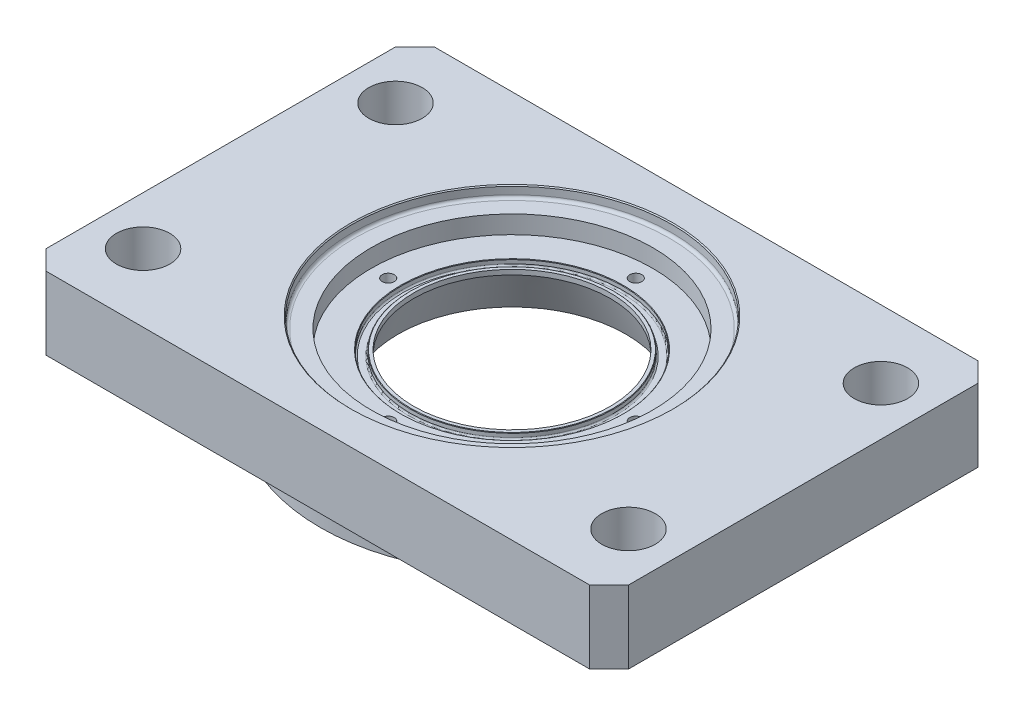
ISO-10303-21;
HEADER;
FILE_DESCRIPTION(('STEP AP214'),'2;1');
FILE_NAME('part.step','',(''),(''),'','','');
FILE_SCHEMA(('AUTOMOTIVE_DESIGN { 1 0 10303 214 1 1 1 1 }'));
ENDSEC;
DATA;
#1=APPLICATION_CONTEXT('core data for automotive mechanical design processes');
#2=APPLICATION_PROTOCOL_DEFINITION('international standard','automotive_design',2000,#1);
#3=PRODUCT_CONTEXT('',#1,'mechanical');
#4=PRODUCT('Part','Part','',(#3));
#5=PRODUCT_RELATED_PRODUCT_CATEGORY('part','',(#4));
#6=PRODUCT_DEFINITION_FORMATION('','',#4);
#7=PRODUCT_DEFINITION_CONTEXT('part definition',#1,'design');
#8=PRODUCT_DEFINITION('design','',#6,#7);
#9=PRODUCT_DEFINITION_SHAPE('','',#8);
#10=(LENGTH_UNIT() NAMED_UNIT(*) SI_UNIT(.MILLI.,.METRE.));
#11=(NAMED_UNIT(*) PLANE_ANGLE_UNIT() SI_UNIT($,.RADIAN.));
#12=(NAMED_UNIT(*) SI_UNIT($,.STERADIAN.) SOLID_ANGLE_UNIT());
#13=UNCERTAINTY_MEASURE_WITH_UNIT(LENGTH_MEASURE(1.E-05),#10,'distance_accuracy_value','');
#14=(GEOMETRIC_REPRESENTATION_CONTEXT(3) GLOBAL_UNCERTAINTY_ASSIGNED_CONTEXT((#13)) GLOBAL_UNIT_ASSIGNED_CONTEXT((#10,
#11,#12)) REPRESENTATION_CONTEXT('',''));
#15=CARTESIAN_POINT('',(0.,0.,0.));
#16=DIRECTION('',(0.,0.,1.));
#17=DIRECTION('',(1.,0.,0.));
#18=AXIS2_PLACEMENT_3D('',#15,#16,#17);
#19=CARTESIAN_POINT('',(0.,12.,0.));
#20=DIRECTION('',(0.,1.,0.));
#21=DIRECTION('',(0.,0.,1.));
#22=AXIS2_PLACEMENT_3D('',#19,#20,#21);
#23=CYLINDRICAL_SURFACE('',#22,21.);
#24=CARTESIAN_POINT('',(0.,11.15,0.));
#25=DIRECTION('',(0.,1.,0.));
#26=DIRECTION('',(0.999942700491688,0.,0.0107049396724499));
#27=AXIS2_PLACEMENT_3D('',#24,#25,#26);
#28=CIRCLE('',#27,21.);
#29=CARTESIAN_POINT('',(20.9987967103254,11.15,0.224803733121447));
#30=VERTEX_POINT('',#29);
#31=EDGE_CURVE('E308',#30,#30,#28,.T.);
#32=ORIENTED_EDGE('',*,*,#31,.T.);
#33=EDGE_LOOP('',(#32));
#34=FACE_BOUND('',#33,.T.);
#35=CARTESIAN_POINT('',(0.,11.9,0.));
#36=DIRECTION('',(0.,-1.,0.));
#37=DIRECTION('',(0.,0.,-1.));
#38=AXIS2_PLACEMENT_3D('',#35,#36,#37);
#39=CIRCLE('',#38,21.);
#40=CARTESIAN_POINT('',(0.,11.9,-21.));
#41=VERTEX_POINT('',#40);
#42=EDGE_CURVE('E116',#41,#41,#39,.F.);
#43=ORIENTED_EDGE('',*,*,#42,.F.);
#44=EDGE_LOOP('',(#43));
#45=FACE_BOUND('',#44,.T.);
#46=ADVANCED_FACE('F16',(#34,#45),#23,.T.);
#47=CARTESIAN_POINT('',(0.,11.15,0.));
#48=DIRECTION('',(0.,1.,0.));
#49=DIRECTION('',(0.999942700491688,0.,0.0107049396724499));
#50=AXIS2_PLACEMENT_3D('',#47,#48,#49);
#51=TOROIDAL_SURFACE('',#50,21.3,0.3);
#52=ORIENTED_EDGE('',*,*,#31,.F.);
#53=EDGE_LOOP('',(#52));
#54=FACE_BOUND('',#53,.T.);
#55=CARTESIAN_POINT('',(0.,10.85,0.));
#56=DIRECTION('',(0.,1.,0.));
#57=DIRECTION('',(-1.,0.,0.));
#58=AXIS2_PLACEMENT_3D('',#55,#56,#57);
#59=CIRCLE('',#58,21.3);
#60=CARTESIAN_POINT('',(21.3,10.85,0.));
#61=VERTEX_POINT('',#60);
#62=CARTESIAN_POINT('',(-21.3,10.85,0.));
#63=VERTEX_POINT('',#62);
#64=EDGE_CURVE('E112',#61,#63,#59,.F.);
#65=ORIENTED_EDGE('',*,*,#64,.F.);
#66=CARTESIAN_POINT('',(0.,10.85,0.));
#67=DIRECTION('',(0.,1.,0.));
#68=DIRECTION('',(1.,0.,0.));
#69=AXIS2_PLACEMENT_3D('',#66,#67,#68);
#70=CIRCLE('',#69,21.3);
#71=EDGE_CURVE('E109',#63,#61,#70,.F.);
#72=ORIENTED_EDGE('',*,*,#71,.F.);
#73=EDGE_LOOP('',(#65,#72));
#74=FACE_BOUND('',#73,.T.);
#75=ADVANCED_FACE('F113',(#54,#74),#51,.F.);
#76=CARTESIAN_POINT('',(0.,11.9,0.));
#77=DIRECTION('',(0.,-1.,0.));
#78=DIRECTION('',(0.,0.,-1.));
#79=AXIS2_PLACEMENT_3D('',#76,#77,#78);
#80=CONICAL_SURFACE('',#79,21.,0.785398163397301);
#81=ORIENTED_EDGE('',*,*,#42,.T.);
#82=EDGE_LOOP('',(#81));
#83=FACE_BOUND('',#82,.T.);
#84=CARTESIAN_POINT('',(0.,12.,0.));
#85=DIRECTION('',(0.,-1.,0.));
#86=DIRECTION('',(0.,0.,-1.));
#87=AXIS2_PLACEMENT_3D('',#84,#85,#86);
#88=CIRCLE('',#87,20.9);
#89=CARTESIAN_POINT('',(0.,12.,-20.9));
#90=VERTEX_POINT('',#89);
#91=EDGE_CURVE('E121',#90,#90,#88,.T.);
#92=ORIENTED_EDGE('',*,*,#91,.T.);
#93=EDGE_LOOP('',(#92));
#94=FACE_BOUND('',#93,.T.);
#95=ADVANCED_FACE('F142',(#83,#94),#80,.T.);
#96=CARTESIAN_POINT('',(0.,10.85,0.));
#97=DIRECTION('',(0.,1.,0.));
#98=DIRECTION('',(0.,0.,1.));
#99=AXIS2_PLACEMENT_3D('',#96,#97,#98);
#100=PLANE('',#99);
#101=ORIENTED_EDGE('',*,*,#64,.T.);
#102=ORIENTED_EDGE('',*,*,#71,.T.);
#103=EDGE_LOOP('',(#101,#102));
#104=FACE_BOUND('',#103,.T.);
#105=CARTESIAN_POINT('',(0.,10.85,0.));
#106=DIRECTION('',(0.,-1.,0.));
#107=DIRECTION('',(1.,0.,0.));
#108=AXIS2_PLACEMENT_3D('',#105,#106,#107);
#109=CIRCLE('',#108,22.55);
#110=CARTESIAN_POINT('',(-22.55,10.85,0.));
#111=VERTEX_POINT('',#110);
#112=CARTESIAN_POINT('',(22.55,10.85,0.));
#113=VERTEX_POINT('',#112);
#114=EDGE_CURVE('E162',#111,#113,#109,.F.);
#115=ORIENTED_EDGE('',*,*,#114,.T.);
#116=CARTESIAN_POINT('',(0.,10.85,0.));
#117=DIRECTION('',(0.,-1.,0.));
#118=DIRECTION('',(-1.,0.,0.));
#119=AXIS2_PLACEMENT_3D('',#116,#117,#118);
#120=CIRCLE('',#119,22.55);
#121=EDGE_CURVE('E161',#113,#111,#120,.F.);
#122=ORIENTED_EDGE('',*,*,#121,.T.);
#123=EDGE_LOOP('',(#115,#122));
#124=FACE_BOUND('',#123,.T.);
#125=ADVANCED_FACE('F119',(#104,#124),#100,.T.);
#126=CARTESIAN_POINT('',(0.,12.,0.));
#127=DIRECTION('',(0.,-1.,0.));
#128=DIRECTION('',(0.,0.,-1.));
#129=AXIS2_PLACEMENT_3D('',#126,#127,#128);
#130=PLANE('',#129);
#131=CARTESIAN_POINT('',(0.,12.,0.));
#132=DIRECTION('',(0.,1.,0.));
#133=DIRECTION('',(0.,0.,1.));
#134=AXIS2_PLACEMENT_3D('',#131,#132,#133);
#135=CIRCLE('',#134,20.25);
#136=CARTESIAN_POINT('',(0.,12.,20.25));
#137=VERTEX_POINT('',#136);
#138=EDGE_CURVE('E166',#137,#137,#135,.F.);
#139=ORIENTED_EDGE('',*,*,#138,.T.);
#140=EDGE_LOOP('',(#139));
#141=FACE_BOUND('',#140,.T.);
#142=ORIENTED_EDGE('',*,*,#91,.F.);
#143=EDGE_LOOP('',(#142));
#144=FACE_BOUND('',#143,.T.);
#145=ADVANCED_FACE('F141',(#141,#144),#130,.F.);
#146=CARTESIAN_POINT('',(0.,11.15,0.));
#147=DIRECTION('',(0.,1.,0.));
#148=DIRECTION('',(0.999902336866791,0.,-0.0139755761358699));
#149=AXIS2_PLACEMENT_3D('',#146,#147,#148);
#150=TOROIDAL_SURFACE('',#149,22.55,0.3);
#151=CARTESIAN_POINT('',(0.,11.15,0.));
#152=DIRECTION('',(0.,1.,0.));
#153=DIRECTION('',(0.,0.,1.));
#154=AXIS2_PLACEMENT_3D('',#151,#152,#153);
#155=CIRCLE('',#154,22.85);
#156=CARTESIAN_POINT('',(0.,11.15,22.85));
#157=VERTEX_POINT('',#156);
#158=EDGE_CURVE('E168',#157,#157,#155,.T.);
#159=ORIENTED_EDGE('',*,*,#158,.T.);
#160=EDGE_LOOP('',(#159));
#161=FACE_BOUND('',#160,.T.);
#162=ORIENTED_EDGE('',*,*,#121,.F.);
#163=ORIENTED_EDGE('',*,*,#114,.F.);
#164=EDGE_LOOP('',(#162,#163));
#165=FACE_BOUND('',#164,.T.);
#166=ADVANCED_FACE('F165',(#161,#165),#150,.F.);
#167=CARTESIAN_POINT('',(0.,2.55,0.));
#168=DIRECTION('',(0.,1.,0.));
#169=DIRECTION('',(0.,0.,1.));
#170=AXIS2_PLACEMENT_3D('',#167,#168,#169);
#171=CYLINDRICAL_SURFACE('',#170,20.25);
#172=CARTESIAN_POINT('',(0.,10.9999999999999,0.));
#173=DIRECTION('',(0.,-1.,0.));
#174=DIRECTION('',(-1.,0.,0.));
#175=AXIS2_PLACEMENT_3D('',#172,#173,#174);
#176=CIRCLE('',#175,20.2499999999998);
#177=CARTESIAN_POINT('',(-20.2499999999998,10.9999999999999,0.));
#178=VERTEX_POINT('',#177);
#179=EDGE_CURVE('E173',#178,#178,#176,.T.);
#180=ORIENTED_EDGE('',*,*,#179,.T.);
#181=EDGE_LOOP('',(#180));
#182=FACE_BOUND('',#181,.T.);
#183=ORIENTED_EDGE('',*,*,#138,.F.);
#184=EDGE_LOOP('',(#183));
#185=FACE_BOUND('',#184,.T.);
#186=ADVANCED_FACE('F273',(#182,#185),#171,.F.);
#187=CARTESIAN_POINT('',(-25.5,5.49999999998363,0.));
#188=DIRECTION('',(0.,1.,0.));
#189=DIRECTION('',(0.,0.,1.));
#190=AXIS2_PLACEMENT_3D('',#187,#188,#189);
#191=CONICAL_SURFACE('',#190,1.24999999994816,1.0297442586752);
#192=CARTESIAN_POINT('',(-25.5,5.5,0.));
#193=DIRECTION('',(0.,1.,0.));
#194=DIRECTION('',(0.,0.,1.));
#195=AXIS2_PLACEMENT_3D('',#192,#193,#194);
#196=CIRCLE('',#195,1.25);
#197=CARTESIAN_POINT('',(-25.5,5.5,1.25));
#198=VERTEX_POINT('',#197);
#199=EDGE_CURVE('E264',#198,#198,#196,.T.);
#200=ORIENTED_EDGE('',*,*,#199,.T.);
#201=EDGE_LOOP('',(#200));
#202=FACE_BOUND('',#201,.T.);
#203=CARTESIAN_POINT('',(-25.4999999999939,4.74892422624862,0.));
#204=VERTEX_POINT('',#203);
#205=VERTEX_LOOP('',#204);
#206=FACE_BOUND('',#205,.T.);
#207=ADVANCED_FACE('F656',(#202,#206),#191,.F.);
#208=CARTESIAN_POINT('',(0.,5.49999999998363,25.5));
#209=DIRECTION('',(0.,1.,0.));
#210=DIRECTION('',(0.,0.,1.));
#211=AXIS2_PLACEMENT_3D('',#208,#209,#210);
#212=CONICAL_SURFACE('',#211,1.24999999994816,1.0297442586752);
#213=CARTESIAN_POINT('',(0.,5.5,25.5));
#214=DIRECTION('',(0.,1.,0.));
#215=DIRECTION('',(0.,0.,1.));
#216=AXIS2_PLACEMENT_3D('',#213,#214,#215);
#217=CIRCLE('',#216,1.25);
#218=CARTESIAN_POINT('',(0.,5.5,26.75));
#219=VERTEX_POINT('',#218);
#220=EDGE_CURVE('E261',#219,#219,#217,.T.);
#221=ORIENTED_EDGE('',*,*,#220,.T.);
#222=EDGE_LOOP('',(#221));
#223=FACE_BOUND('',#222,.T.);
#224=CARTESIAN_POINT('',(0.,4.74892422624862,25.4999999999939));
#225=VERTEX_POINT('',#224);
#226=VERTEX_LOOP('',#225);
#227=FACE_BOUND('',#226,.T.);
#228=ADVANCED_FACE('F652',(#223,#227),#212,.F.);
#229=CARTESIAN_POINT('',(25.5,5.49999999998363,0.));
#230=DIRECTION('',(0.,1.,0.));
#231=DIRECTION('',(0.,0.,1.));
#232=AXIS2_PLACEMENT_3D('',#229,#230,#231);
#233=CONICAL_SURFACE('',#232,1.24999999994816,1.0297442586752);
#234=CARTESIAN_POINT('',(25.5,5.5,0.));
#235=DIRECTION('',(0.,1.,0.));
#236=DIRECTION('',(0.,0.,1.));
#237=AXIS2_PLACEMENT_3D('',#234,#235,#236);
#238=CIRCLE('',#237,1.25);
#239=CARTESIAN_POINT('',(25.5,5.5,1.25));
#240=VERTEX_POINT('',#239);
#241=EDGE_CURVE('E258',#240,#240,#238,.T.);
#242=ORIENTED_EDGE('',*,*,#241,.T.);
#243=EDGE_LOOP('',(#242));
#244=FACE_BOUND('',#243,.T.);
#245=CARTESIAN_POINT('',(25.4999999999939,4.74892422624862,0.));
#246=VERTEX_POINT('',#245);
#247=VERTEX_LOOP('',#246);
#248=FACE_BOUND('',#247,.T.);
#249=ADVANCED_FACE('F655',(#244,#248),#233,.F.);
#250=CARTESIAN_POINT('',(0.,5.49999999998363,-25.5));
#251=DIRECTION('',(0.,1.,0.));
#252=DIRECTION('',(0.,0.,1.));
#253=AXIS2_PLACEMENT_3D('',#250,#251,#252);
#254=CONICAL_SURFACE('',#253,1.24999999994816,1.0297442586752);
#255=CARTESIAN_POINT('',(0.,5.5,-25.5));
#256=DIRECTION('',(0.,1.,0.));
#257=DIRECTION('',(0.,0.,1.));
#258=AXIS2_PLACEMENT_3D('',#255,#256,#257);
#259=CIRCLE('',#258,1.25);
#260=CARTESIAN_POINT('',(0.,5.5,-24.25));
#261=VERTEX_POINT('',#260);
#262=EDGE_CURVE('E255',#261,#261,#259,.T.);
#263=ORIENTED_EDGE('',*,*,#262,.T.);
#264=EDGE_LOOP('',(#263));
#265=FACE_BOUND('',#264,.T.);
#266=CARTESIAN_POINT('',(0.,4.74892422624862,-25.4999999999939));
#267=VERTEX_POINT('',#266);
#268=VERTEX_LOOP('',#267);
#269=FACE_BOUND('',#268,.T.);
#270=ADVANCED_FACE('F414',(#265,#269),#254,.F.);
#271=CARTESIAN_POINT('',(0.,12.,0.));
#272=DIRECTION('',(0.,1.,0.));
#273=DIRECTION('',(0.,0.,1.));
#274=AXIS2_PLACEMENT_3D('',#271,#272,#273);
#275=CYLINDRICAL_SURFACE('',#274,22.85);
#276=ORIENTED_EDGE('',*,*,#158,.F.);
#277=EDGE_LOOP('',(#276));
#278=FACE_BOUND('',#277,.T.);
#279=CARTESIAN_POINT('',(0.,11.9,0.));
#280=DIRECTION('',(0.,1.,0.));
#281=DIRECTION('',(0.,0.,-1.));
#282=AXIS2_PLACEMENT_3D('',#279,#280,#281);
#283=CIRCLE('',#282,22.85);
#284=CARTESIAN_POINT('',(0.,11.9,-22.85));
#285=VERTEX_POINT('',#284);
#286=EDGE_CURVE('E247',#285,#285,#283,.T.);
#287=ORIENTED_EDGE('',*,*,#286,.T.);
#288=EDGE_LOOP('',(#287));
#289=FACE_BOUND('',#288,.T.);
#290=ADVANCED_FACE('F403',(#278,#289),#275,.F.);
#291=CARTESIAN_POINT('',(0.,3.0000000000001,0.));
#292=DIRECTION('',(0.,-1.,0.));
#293=DIRECTION('',(0.,0.,-1.));
#294=AXIS2_PLACEMENT_3D('',#291,#292,#293);
#295=CONICAL_SURFACE('',#294,23.4822098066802,0.38397243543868);
#296=ORIENTED_EDGE('',*,*,#179,.F.);
#297=EDGE_LOOP('',(#296));
#298=FACE_BOUND('',#297,.T.);
#299=CARTESIAN_POINT('',(0.,3.0000000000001,0.));
#300=DIRECTION('',(0.,-1.,0.));
#301=DIRECTION('',(0.,0.,-1.));
#302=AXIS2_PLACEMENT_3D('',#299,#300,#301);
#303=CIRCLE('',#302,23.4822098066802);
#304=CARTESIAN_POINT('',(0.,3.0000000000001,-23.4822098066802));
#305=VERTEX_POINT('',#304);
#306=EDGE_CURVE('E177',#305,#305,#303,.F.);
#307=ORIENTED_EDGE('',*,*,#306,.F.);
#308=EDGE_LOOP('',(#307));
#309=FACE_BOUND('',#308,.T.);
#310=ADVANCED_FACE('F400',(#298,#309),#295,.F.);
#311=CARTESIAN_POINT('',(-25.5,4.386370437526,0.));
#312=DIRECTION('',(0.,1.,0.));
#313=DIRECTION('',(0.,0.,1.));
#314=AXIS2_PLACEMENT_3D('',#311,#312,#313);
#315=CYLINDRICAL_SURFACE('',#314,1.25);
#316=ORIENTED_EDGE('',*,*,#199,.F.);
#317=EDGE_LOOP('',(#316));
#318=FACE_BOUND('',#317,.T.);
#319=CARTESIAN_POINT('',(-25.5,12.,0.));
#320=DIRECTION('',(0.,1.,0.));
#321=DIRECTION('',(0.,0.,1.));
#322=AXIS2_PLACEMENT_3D('',#319,#320,#321);
#323=CIRCLE('',#322,1.25);
#324=CARTESIAN_POINT('',(-25.5,12.,1.25));
#325=VERTEX_POINT('',#324);
#326=EDGE_CURVE('E390',#325,#325,#323,.T.);
#327=ORIENTED_EDGE('',*,*,#326,.T.);
#328=EDGE_LOOP('',(#327));
#329=FACE_BOUND('',#328,.T.);
#330=ADVANCED_FACE('F402',(#318,#329),#315,.F.);
#331=CARTESIAN_POINT('',(0.,4.386370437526,25.5));
#332=DIRECTION('',(0.,1.,0.));
#333=DIRECTION('',(0.,0.,1.));
#334=AXIS2_PLACEMENT_3D('',#331,#332,#333);
#335=CYLINDRICAL_SURFACE('',#334,1.25);
#336=ORIENTED_EDGE('',*,*,#220,.F.);
#337=EDGE_LOOP('',(#336));
#338=FACE_BOUND('',#337,.T.);
#339=CARTESIAN_POINT('',(0.,12.,25.5));
#340=DIRECTION('',(0.,1.,0.));
#341=DIRECTION('',(0.,0.,1.));
#342=AXIS2_PLACEMENT_3D('',#339,#340,#341);
#343=CIRCLE('',#342,1.25);
#344=CARTESIAN_POINT('',(0.,12.,26.75));
#345=VERTEX_POINT('',#344);
#346=EDGE_CURVE('E388',#345,#345,#343,.T.);
#347=ORIENTED_EDGE('',*,*,#346,.T.);
#348=EDGE_LOOP('',(#347));
#349=FACE_BOUND('',#348,.T.);
#350=ADVANCED_FACE('F411',(#338,#349),#335,.F.);
#351=CARTESIAN_POINT('',(25.5,4.386370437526,0.));
#352=DIRECTION('',(0.,1.,0.));
#353=DIRECTION('',(0.,0.,1.));
#354=AXIS2_PLACEMENT_3D('',#351,#352,#353);
#355=CYLINDRICAL_SURFACE('',#354,1.25);
#356=ORIENTED_EDGE('',*,*,#241,.F.);
#357=EDGE_LOOP('',(#356));
#358=FACE_BOUND('',#357,.T.);
#359=CARTESIAN_POINT('',(25.5,12.,0.));
#360=DIRECTION('',(0.,1.,0.));
#361=DIRECTION('',(0.,0.,1.));
#362=AXIS2_PLACEMENT_3D('',#359,#360,#361);
#363=CIRCLE('',#362,1.25);
#364=CARTESIAN_POINT('',(25.5,12.,1.25));
#365=VERTEX_POINT('',#364);
#366=EDGE_CURVE('E385',#365,#365,#363,.T.);
#367=ORIENTED_EDGE('',*,*,#366,.T.);
#368=EDGE_LOOP('',(#367));
#369=FACE_BOUND('',#368,.T.);
#370=ADVANCED_FACE('F633',(#358,#369),#355,.F.);
#371=CARTESIAN_POINT('',(0.,4.386370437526,-25.5));
#372=DIRECTION('',(0.,1.,0.));
#373=DIRECTION('',(0.,0.,1.));
#374=AXIS2_PLACEMENT_3D('',#371,#372,#373);
#375=CYLINDRICAL_SURFACE('',#374,1.25);
#376=ORIENTED_EDGE('',*,*,#262,.F.);
#377=EDGE_LOOP('',(#376));
#378=FACE_BOUND('',#377,.T.);
#379=CARTESIAN_POINT('',(0.,12.,-25.5));
#380=DIRECTION('',(0.,1.,0.));
#381=DIRECTION('',(0.,0.,1.));
#382=AXIS2_PLACEMENT_3D('',#379,#380,#381);
#383=CIRCLE('',#382,1.25);
#384=CARTESIAN_POINT('',(0.,12.,-24.25));
#385=VERTEX_POINT('',#384);
#386=EDGE_CURVE('E382',#385,#385,#383,.T.);
#387=ORIENTED_EDGE('',*,*,#386,.T.);
#388=EDGE_LOOP('',(#387));
#389=FACE_BOUND('',#388,.T.);
#390=ADVANCED_FACE('F629',(#378,#389),#375,.F.);
#391=CARTESIAN_POINT('',(0.,12.,0.));
#392=DIRECTION('',(0.,1.,0.));
#393=DIRECTION('',(-1.,0.,0.));
#394=AXIS2_PLACEMENT_3D('',#391,#392,#393);
#395=CONICAL_SURFACE('',#394,22.95,0.785398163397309);
#396=ORIENTED_EDGE('',*,*,#286,.F.);
#397=EDGE_LOOP('',(#396));
#398=FACE_BOUND('',#397,.T.);
#399=CARTESIAN_POINT('',(0.,12.,0.));
#400=DIRECTION('',(0.,1.,0.));
#401=DIRECTION('',(-1.,0.,0.));
#402=AXIS2_PLACEMENT_3D('',#399,#400,#401);
#403=CIRCLE('',#402,22.95);
#404=CARTESIAN_POINT('',(-22.95,12.,0.));
#405=VERTEX_POINT('',#404);
#406=EDGE_CURVE('E379',#405,#405,#403,.T.);
#407=ORIENTED_EDGE('',*,*,#406,.T.);
#408=EDGE_LOOP('',(#407));
#409=FACE_BOUND('',#408,.T.);
#410=ADVANCED_FACE('F626',(#398,#409),#395,.F.);
#411=CARTESIAN_POINT('',(0.,3.,0.));
#412=DIRECTION('',(0.,-1.,0.));
#413=DIRECTION('',(0.,0.,-1.));
#414=AXIS2_PLACEMENT_3D('',#411,#412,#413);
#415=PLANE('',#414);
#416=ORIENTED_EDGE('',*,*,#306,.T.);
#417=EDGE_LOOP('',(#416));
#418=FACE_BOUND('',#417,.T.);
#419=CARTESIAN_POINT('',(0.,3.,0.));
#420=DIRECTION('',(0.,-1.,0.));
#421=DIRECTION('',(0.,0.,-1.));
#422=AXIS2_PLACEMENT_3D('',#419,#420,#421);
#423=CIRCLE('',#422,38.);
#424=CARTESIAN_POINT('',(0.,3.,-38.));
#425=VERTEX_POINT('',#424);
#426=EDGE_CURVE('E376',#425,#425,#423,.T.);
#427=ORIENTED_EDGE('',*,*,#426,.T.);
#428=EDGE_LOOP('',(#427));
#429=FACE_BOUND('',#428,.T.);
#430=ADVANCED_FACE('F397',(#418,#429),#415,.T.);
#431=CARTESIAN_POINT('',(0.,12.,0.));
#432=DIRECTION('',(0.,-1.,0.));
#433=DIRECTION('',(0.,0.,-1.));
#434=AXIS2_PLACEMENT_3D('',#431,#432,#433);
#435=PLANE('',#434);
#436=ORIENTED_EDGE('',*,*,#406,.F.);
#437=EDGE_LOOP('',(#436));
#438=FACE_BOUND('',#437,.T.);
#439=ORIENTED_EDGE('',*,*,#386,.F.);
#440=EDGE_LOOP('',(#439));
#441=FACE_BOUND('',#440,.T.);
#442=ORIENTED_EDGE('',*,*,#366,.F.);
#443=EDGE_LOOP('',(#442));
#444=FACE_BOUND('',#443,.T.);
#445=ORIENTED_EDGE('',*,*,#346,.F.);
#446=EDGE_LOOP('',(#445));
#447=FACE_BOUND('',#446,.T.);
#448=ORIENTED_EDGE('',*,*,#326,.F.);
#449=EDGE_LOOP('',(#448));
#450=FACE_BOUND('',#449,.T.);
#451=CARTESIAN_POINT('',(0.,12.,0.));
#452=DIRECTION('',(0.,-1.,0.));
#453=DIRECTION('',(0.,0.,-1.));
#454=AXIS2_PLACEMENT_3D('',#451,#452,#453);
#455=CIRCLE('',#454,29.);
#456=CARTESIAN_POINT('',(0.,12.,-29.));
#457=VERTEX_POINT('',#456);
#458=EDGE_CURVE('E373',#457,#457,#455,.F.);
#459=ORIENTED_EDGE('',*,*,#458,.T.);
#460=EDGE_LOOP('',(#459));
#461=FACE_BOUND('',#460,.T.);
#462=ADVANCED_FACE('F614',(#438,#441,#444,#447,#450,#461),#435,.F.);
#463=CARTESIAN_POINT('',(0.,0.,0.));
#464=DIRECTION('',(0.,-1.,0.));
#465=DIRECTION('',(0.,0.,-1.));
#466=AXIS2_PLACEMENT_3D('',#463,#464,#465);
#467=CYLINDRICAL_SURFACE('',#466,38.);
#468=ORIENTED_EDGE('',*,*,#426,.F.);
#469=EDGE_LOOP('',(#468));
#470=FACE_BOUND('',#469,.T.);
#471=CARTESIAN_POINT('',(0.,0.,0.));
#472=DIRECTION('',(0.,-1.,0.));
#473=DIRECTION('',(0.,0.,-1.));
#474=AXIS2_PLACEMENT_3D('',#471,#472,#473);
#475=CIRCLE('',#474,38.);
#476=CARTESIAN_POINT('',(0.,0.,-38.));
#477=VERTEX_POINT('',#476);
#478=EDGE_CURVE('E370',#477,#477,#475,.T.);
#479=ORIENTED_EDGE('',*,*,#478,.T.);
#480=EDGE_LOOP('',(#479));
#481=FACE_BOUND('',#480,.T.);
#482=ADVANCED_FACE('F609',(#470,#481),#467,.F.);
#483=CARTESIAN_POINT('',(0.,18.,0.));
#484=DIRECTION('',(0.,-1.,0.));
#485=DIRECTION('',(0.,0.,-1.));
#486=AXIS2_PLACEMENT_3D('',#483,#484,#485);
#487=CYLINDRICAL_SURFACE('',#486,29.);
#488=ORIENTED_EDGE('',*,*,#458,.F.);
#489=EDGE_LOOP('',(#488));
#490=FACE_BOUND('',#489,.T.);
#491=CARTESIAN_POINT('',(0.,15.7,0.));
#492=DIRECTION('',(0.,-1.,0.));
#493=DIRECTION('',(0.,0.,-1.));
#494=AXIS2_PLACEMENT_3D('',#491,#492,#493);
#495=CIRCLE('',#494,29.);
#496=CARTESIAN_POINT('',(0.,15.7,-29.));
#497=VERTEX_POINT('',#496);
#498=EDGE_CURVE('E367',#497,#497,#495,.T.);
#499=ORIENTED_EDGE('',*,*,#498,.F.);
#500=EDGE_LOOP('',(#499));
#501=FACE_BOUND('',#500,.T.);
#502=ADVANCED_FACE('F604',(#490,#501),#487,.F.);
#503=CARTESIAN_POINT('',(0.,0.,0.));
#504=DIRECTION('',(0.,1.,0.));
#505=DIRECTION('',(0.,0.,1.));
#506=AXIS2_PLACEMENT_3D('',#503,#504,#505);
#507=PLANE('',#506);
#508=ORIENTED_EDGE('',*,*,#478,.F.);
#509=EDGE_LOOP('',(#508));
#510=FACE_BOUND('',#509,.T.);
#511=CARTESIAN_POINT('',(0.,0.,0.));
#512=DIRECTION('',(0.,-1.,0.));
#513=DIRECTION('',(0.,0.,-1.));
#514=AXIS2_PLACEMENT_3D('',#511,#512,#513);
#515=CIRCLE('',#514,39.5);
#516=CARTESIAN_POINT('',(0.,0.,-39.5));
#517=VERTEX_POINT('',#516);
#518=EDGE_CURVE('E364',#517,#517,#515,.F.);
#519=ORIENTED_EDGE('',*,*,#518,.F.);
#520=EDGE_LOOP('',(#519));
#521=FACE_BOUND('',#520,.T.);
#522=ADVANCED_FACE('F230',(#510,#521),#507,.F.);
#523=CARTESIAN_POINT('',(0.,15.7,0.));
#524=DIRECTION('',(0.,1.,0.));
#525=DIRECTION('',(0.,0.,1.));
#526=AXIS2_PLACEMENT_3D('',#523,#524,#525);
#527=PLANE('',#526);
#528=ORIENTED_EDGE('',*,*,#498,.T.);
#529=EDGE_LOOP('',(#528));
#530=FACE_BOUND('',#529,.T.);
#531=CARTESIAN_POINT('',(0.,15.7,0.));
#532=DIRECTION('',(0.,-1.,0.));
#533=DIRECTION('',(1.,0.,0.));
#534=AXIS2_PLACEMENT_3D('',#531,#532,#533);
#535=CIRCLE('',#534,32.4);
#536=CARTESIAN_POINT('',(-32.4,15.7,0.));
#537=VERTEX_POINT('',#536);
#538=CARTESIAN_POINT('',(32.4,15.7,0.));
#539=VERTEX_POINT('',#538);
#540=EDGE_CURVE('E185',#537,#539,#535,.F.);
#541=ORIENTED_EDGE('',*,*,#540,.T.);
#542=CARTESIAN_POINT('',(0.,15.7,0.));
#543=DIRECTION('',(0.,-1.,0.));
#544=DIRECTION('',(-1.,0.,0.));
#545=AXIS2_PLACEMENT_3D('',#542,#543,#544);
#546=CIRCLE('',#545,32.4);
#547=EDGE_CURVE('E243',#539,#537,#546,.F.);
#548=ORIENTED_EDGE('',*,*,#547,.T.);
#549=EDGE_LOOP('',(#541,#548));
#550=FACE_BOUND('',#549,.T.);
#551=ADVANCED_FACE('F219',(#530,#550),#527,.T.);
#552=CARTESIAN_POINT('',(0.,0.,0.));
#553=DIRECTION('',(0.,-1.,0.));
#554=DIRECTION('',(0.,0.,-1.));
#555=AXIS2_PLACEMENT_3D('',#552,#553,#554);
#556=CYLINDRICAL_SURFACE('',#555,39.5);
#557=CARTESIAN_POINT('',(0.,3.,0.));
#558=DIRECTION('',(0.,-1.,0.));
#559=DIRECTION('',(0.,0.,-1.));
#560=AXIS2_PLACEMENT_3D('',#557,#558,#559);
#561=CIRCLE('',#560,39.5);
#562=CARTESIAN_POINT('',(0.,3.,-39.5));
#563=VERTEX_POINT('',#562);
#564=EDGE_CURVE('E361',#563,#563,#561,.F.);
#565=ORIENTED_EDGE('',*,*,#564,.F.);
#566=EDGE_LOOP('',(#565));
#567=FACE_BOUND('',#566,.T.);
#568=ORIENTED_EDGE('',*,*,#518,.T.);
#569=EDGE_LOOP('',(#568));
#570=FACE_BOUND('',#569,.T.);
#571=ADVANCED_FACE('F229',(#567,#570),#556,.T.);
#572=CARTESIAN_POINT('',(-50.,3.,26.));
#573=DIRECTION('',(0.,1.,0.));
#574=DIRECTION('',(0.,0.,1.));
#575=AXIS2_PLACEMENT_3D('',#572,#573,#574);
#576=CYLINDRICAL_SURFACE('',#575,8.5);
#577=CARTESIAN_POINT('',(-50.,8.,26.));
#578=DIRECTION('',(0.,1.,0.));
#579=DIRECTION('',(0.,0.,1.));
#580=AXIS2_PLACEMENT_3D('',#577,#578,#579);
#581=CIRCLE('',#580,8.5);
#582=CARTESIAN_POINT('',(-50.,8.,34.5));
#583=VERTEX_POINT('',#582);
#584=EDGE_CURVE('E346',#583,#583,#581,.T.);
#585=ORIENTED_EDGE('',*,*,#584,.T.);
#586=EDGE_LOOP('',(#585));
#587=FACE_BOUND('',#586,.T.);
#588=CARTESIAN_POINT('',(-50.,3.,26.));
#589=DIRECTION('',(0.,1.,0.));
#590=DIRECTION('',(0.,0.,1.));
#591=AXIS2_PLACEMENT_3D('',#588,#589,#590);
#592=CIRCLE('',#591,8.5);
#593=CARTESIAN_POINT('',(-50.,3.,34.5));
#594=VERTEX_POINT('',#593);
#595=EDGE_CURVE('E352',#594,#594,#592,.T.);
#596=ORIENTED_EDGE('',*,*,#595,.F.);
#597=EDGE_LOOP('',(#596));
#598=FACE_BOUND('',#597,.T.);
#599=ADVANCED_FACE('F503',(#587,#598),#576,.F.);
#600=CARTESIAN_POINT('',(50.,3.,-26.));
#601=DIRECTION('',(0.,1.,0.));
#602=DIRECTION('',(0.,0.,1.));
#603=AXIS2_PLACEMENT_3D('',#600,#601,#602);
#604=CYLINDRICAL_SURFACE('',#603,8.5);
#605=CARTESIAN_POINT('',(50.,8.,-26.));
#606=DIRECTION('',(0.,1.,0.));
#607=DIRECTION('',(0.,0.,1.));
#608=AXIS2_PLACEMENT_3D('',#605,#606,#607);
#609=CIRCLE('',#608,8.5);
#610=CARTESIAN_POINT('',(50.,8.,-17.5));
#611=VERTEX_POINT('',#610);
#612=EDGE_CURVE('E343',#611,#611,#609,.T.);
#613=ORIENTED_EDGE('',*,*,#612,.T.);
#614=EDGE_LOOP('',(#613));
#615=FACE_BOUND('',#614,.T.);
#616=CARTESIAN_POINT('',(50.,3.,-26.));
#617=DIRECTION('',(0.,1.,0.));
#618=DIRECTION('',(0.,0.,1.));
#619=AXIS2_PLACEMENT_3D('',#616,#617,#618);
#620=CIRCLE('',#619,8.5);
#621=CARTESIAN_POINT('',(50.,3.,-17.5));
#622=VERTEX_POINT('',#621);
#623=EDGE_CURVE('E358',#622,#622,#620,.T.);
#624=ORIENTED_EDGE('',*,*,#623,.F.);
#625=EDGE_LOOP('',(#624));
#626=FACE_BOUND('',#625,.T.);
#627=ADVANCED_FACE('F506',(#615,#626),#604,.F.);
#628=CARTESIAN_POINT('',(-50.,3.,-26.));
#629=DIRECTION('',(0.,1.,0.));
#630=DIRECTION('',(0.,0.,1.));
#631=AXIS2_PLACEMENT_3D('',#628,#629,#630);
#632=CYLINDRICAL_SURFACE('',#631,8.5);
#633=CARTESIAN_POINT('',(-50.,8.,-26.));
#634=DIRECTION('',(0.,1.,0.));
#635=DIRECTION('',(0.,0.,1.));
#636=AXIS2_PLACEMENT_3D('',#633,#634,#635);
#637=CIRCLE('',#636,8.5);
#638=CARTESIAN_POINT('',(-50.,8.,-17.5));
#639=VERTEX_POINT('',#638);
#640=EDGE_CURVE('E340',#639,#639,#637,.T.);
#641=ORIENTED_EDGE('',*,*,#640,.T.);
#642=EDGE_LOOP('',(#641));
#643=FACE_BOUND('',#642,.T.);
#644=CARTESIAN_POINT('',(-50.,3.,-26.));
#645=DIRECTION('',(0.,1.,0.));
#646=DIRECTION('',(0.,0.,1.));
#647=AXIS2_PLACEMENT_3D('',#644,#645,#646);
#648=CIRCLE('',#647,8.5);
#649=CARTESIAN_POINT('',(-50.,3.,-17.5));
#650=VERTEX_POINT('',#649);
#651=EDGE_CURVE('E355',#650,#650,#648,.T.);
#652=ORIENTED_EDGE('',*,*,#651,.F.);
#653=EDGE_LOOP('',(#652));
#654=FACE_BOUND('',#653,.T.);
#655=ADVANCED_FACE('F774',(#643,#654),#632,.F.);
#656=CARTESIAN_POINT('',(50.,3.,26.));
#657=DIRECTION('',(0.,1.,0.));
#658=DIRECTION('',(0.,0.,1.));
#659=AXIS2_PLACEMENT_3D('',#656,#657,#658);
#660=CYLINDRICAL_SURFACE('',#659,8.5);
#661=CARTESIAN_POINT('',(50.,8.,26.));
#662=DIRECTION('',(0.,1.,0.));
#663=DIRECTION('',(0.,0.,1.));
#664=AXIS2_PLACEMENT_3D('',#661,#662,#663);
#665=CIRCLE('',#664,8.5);
#666=CARTESIAN_POINT('',(50.,8.,34.5));
#667=VERTEX_POINT('',#666);
#668=EDGE_CURVE('E337',#667,#667,#665,.T.);
#669=ORIENTED_EDGE('',*,*,#668,.T.);
#670=EDGE_LOOP('',(#669));
#671=FACE_BOUND('',#670,.T.);
#672=CARTESIAN_POINT('',(50.,3.,26.));
#673=DIRECTION('',(0.,1.,0.));
#674=DIRECTION('',(0.,0.,1.));
#675=AXIS2_PLACEMENT_3D('',#672,#673,#674);
#676=CIRCLE('',#675,8.5);
#677=CARTESIAN_POINT('',(50.,3.,34.5));
#678=VERTEX_POINT('',#677);
#679=EDGE_CURVE('E349',#678,#678,#676,.T.);
#680=ORIENTED_EDGE('',*,*,#679,.F.);
#681=EDGE_LOOP('',(#680));
#682=FACE_BOUND('',#681,.T.);
#683=ADVANCED_FACE('F201',(#671,#682),#660,.F.);
#684=CARTESIAN_POINT('',(0.,16.3,0.));
#685=DIRECTION('',(0.,1.,0.));
#686=DIRECTION('',(-0.999953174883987,0.,0.00967719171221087));
#687=AXIS2_PLACEMENT_3D('',#684,#685,#686);
#688=TOROIDAL_SURFACE('',#687,32.4,0.6);
#689=CARTESIAN_POINT('',(0.,16.3,0.));
#690=DIRECTION('',(0.,1.,0.));
#691=DIRECTION('',(0.,0.,1.));
#692=AXIS2_PLACEMENT_3D('',#689,#690,#691);
#693=CIRCLE('',#692,33.);
#694=CARTESIAN_POINT('',(0.,16.3,33.));
#695=VERTEX_POINT('',#694);
#696=EDGE_CURVE('E210',#695,#695,#693,.T.);
#697=ORIENTED_EDGE('',*,*,#696,.T.);
#698=EDGE_LOOP('',(#697));
#699=FACE_BOUND('',#698,.T.);
#700=ORIENTED_EDGE('',*,*,#540,.F.);
#701=ORIENTED_EDGE('',*,*,#547,.F.);
#702=EDGE_LOOP('',(#700,#701));
#703=FACE_BOUND('',#702,.T.);
#704=ADVANCED_FACE('F189',(#699,#703),#688,.F.);
#705=CARTESIAN_POINT('',(0.,3.,0.));
#706=DIRECTION('',(0.,-1.,0.));
#707=DIRECTION('',(0.,0.,-1.));
#708=AXIS2_PLACEMENT_3D('',#705,#706,#707);
#709=PLANE('',#708);
#710=ORIENTED_EDGE('',*,*,#679,.T.);
#711=EDGE_LOOP('',(#710));
#712=FACE_BOUND('',#711,.T.);
#713=ORIENTED_EDGE('',*,*,#595,.T.);
#714=EDGE_LOOP('',(#713));
#715=FACE_BOUND('',#714,.T.);
#716=ORIENTED_EDGE('',*,*,#651,.T.);
#717=EDGE_LOOP('',(#716));
#718=FACE_BOUND('',#717,.T.);
#719=ORIENTED_EDGE('',*,*,#623,.T.);
#720=EDGE_LOOP('',(#719));
#721=FACE_BOUND('',#720,.T.);
#722=ORIENTED_EDGE('',*,*,#564,.T.);
#723=EDGE_LOOP('',(#722));
#724=FACE_BOUND('',#723,.T.);
#725=DIRECTION('',(0.,0.,1.));
#726=VECTOR('',#725,1.);
#727=CARTESIAN_POINT('',(-60.,3.,-40.));
#728=LINE('',#727,#726);
#729=CARTESIAN_POINT('',(-60.,3.,-36.));
#730=VERTEX_POINT('',#729);
#731=CARTESIAN_POINT('',(-60.,3.,36.));
#732=VERTEX_POINT('',#731);
#733=EDGE_CURVE('E518',#730,#732,#728,.T.);
#734=ORIENTED_EDGE('',*,*,#733,.F.);
#735=DIRECTION('',(-0.707106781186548,0.,0.707106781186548));
#736=VECTOR('',#735,1.);
#737=CARTESIAN_POINT('',(-58.,3.,-38.));
#738=LINE('',#737,#736);
#739=CARTESIAN_POINT('',(-56.,3.,-40.));
#740=VERTEX_POINT('',#739);
#741=EDGE_CURVE('E336',#740,#730,#738,.T.);
#742=ORIENTED_EDGE('',*,*,#741,.F.);
#743=DIRECTION('',(-1.,0.,0.));
#744=VECTOR('',#743,1.);
#745=CARTESIAN_POINT('',(60.,3.,-40.));
#746=LINE('',#745,#744);
#747=CARTESIAN_POINT('',(56.,3.,-40.));
#748=VERTEX_POINT('',#747);
#749=EDGE_CURVE('E532',#748,#740,#746,.T.);
#750=ORIENTED_EDGE('',*,*,#749,.F.);
#751=DIRECTION('',(-0.707106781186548,0.,-0.707106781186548));
#752=VECTOR('',#751,1.);
#753=CARTESIAN_POINT('',(58.,3.,-38.));
#754=LINE('',#753,#752);
#755=CARTESIAN_POINT('',(60.,3.,-36.));
#756=VERTEX_POINT('',#755);
#757=EDGE_CURVE('E543',#756,#748,#754,.T.);
#758=ORIENTED_EDGE('',*,*,#757,.F.);
#759=DIRECTION('',(0.,0.,-1.));
#760=VECTOR('',#759,1.);
#761=CARTESIAN_POINT('',(60.,3.,40.));
#762=LINE('',#761,#760);
#763=CARTESIAN_POINT('',(60.,3.,36.));
#764=VERTEX_POINT('',#763);
#765=EDGE_CURVE('E551',#764,#756,#762,.T.);
#766=ORIENTED_EDGE('',*,*,#765,.F.);
#767=DIRECTION('',(0.707106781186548,0.,-0.707106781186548));
#768=VECTOR('',#767,1.);
#769=CARTESIAN_POINT('',(58.,3.,38.));
#770=LINE('',#769,#768);
#771=CARTESIAN_POINT('',(56.,3.,40.));
#772=VERTEX_POINT('',#771);
#773=EDGE_CURVE('E553',#772,#764,#770,.T.);
#774=ORIENTED_EDGE('',*,*,#773,.F.);
#775=DIRECTION('',(1.,0.,0.));
#776=VECTOR('',#775,1.);
#777=CARTESIAN_POINT('',(-60.,3.,40.));
#778=LINE('',#777,#776);
#779=CARTESIAN_POINT('',(-56.,3.,40.));
#780=VERTEX_POINT('',#779);
#781=EDGE_CURVE('E562',#780,#772,#778,.T.);
#782=ORIENTED_EDGE('',*,*,#781,.F.);
#783=DIRECTION('',(0.707106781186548,0.,0.707106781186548));
#784=VECTOR('',#783,1.);
#785=CARTESIAN_POINT('',(-58.,3.,38.));
#786=LINE('',#785,#784);
#787=EDGE_CURVE('E523',#732,#780,#786,.T.);
#788=ORIENTED_EDGE('',*,*,#787,.F.);
#789=EDGE_LOOP('',(#734,#742,#750,#758,#766,#774,#782,#788));
#790=FACE_BOUND('',#789,.T.);
#791=ADVANCED_FACE('F200',(#712,#715,#718,#721,#724,#790),#709,.T.);
#792=CARTESIAN_POINT('',(-50.,8.,26.));
#793=DIRECTION('',(0.,1.,0.));
#794=DIRECTION('',(0.,0.,1.));
#795=AXIS2_PLACEMENT_3D('',#792,#793,#794);
#796=PLANE('',#795);
#797=CARTESIAN_POINT('',(-50.,8.,26.));
#798=DIRECTION('',(0.,1.,0.));
#799=DIRECTION('',(0.,0.,1.));
#800=AXIS2_PLACEMENT_3D('',#797,#798,#799);
#801=CIRCLE('',#800,5.5);
#802=CARTESIAN_POINT('',(-50.,8.,31.5));
#803=VERTEX_POINT('',#802);
#804=EDGE_CURVE('E333',#803,#803,#801,.T.);
#805=ORIENTED_EDGE('',*,*,#804,.T.);
#806=EDGE_LOOP('',(#805));
#807=FACE_BOUND('',#806,.T.);
#808=ORIENTED_EDGE('',*,*,#584,.F.);
#809=EDGE_LOOP('',(#808));
#810=FACE_BOUND('',#809,.T.);
#811=ADVANCED_FACE('F491',(#807,#810),#796,.F.);
#812=CARTESIAN_POINT('',(50.,8.,-26.));
#813=DIRECTION('',(0.,1.,0.));
#814=DIRECTION('',(0.,0.,1.));
#815=AXIS2_PLACEMENT_3D('',#812,#813,#814);
#816=PLANE('',#815);
#817=CARTESIAN_POINT('',(50.,8.,-26.));
#818=DIRECTION('',(0.,1.,0.));
#819=DIRECTION('',(0.,0.,1.));
#820=AXIS2_PLACEMENT_3D('',#817,#818,#819);
#821=CIRCLE('',#820,5.5);
#822=CARTESIAN_POINT('',(50.,8.,-20.5));
#823=VERTEX_POINT('',#822);
#824=EDGE_CURVE('E330',#823,#823,#821,.T.);
#825=ORIENTED_EDGE('',*,*,#824,.T.);
#826=EDGE_LOOP('',(#825));
#827=FACE_BOUND('',#826,.T.);
#828=ORIENTED_EDGE('',*,*,#612,.F.);
#829=EDGE_LOOP('',(#828));
#830=FACE_BOUND('',#829,.T.);
#831=ADVANCED_FACE('F488',(#827,#830),#816,.F.);
#832=CARTESIAN_POINT('',(-50.,8.,-26.));
#833=DIRECTION('',(0.,1.,0.));
#834=DIRECTION('',(0.,0.,1.));
#835=AXIS2_PLACEMENT_3D('',#832,#833,#834);
#836=PLANE('',#835);
#837=CARTESIAN_POINT('',(-50.,8.,-26.));
#838=DIRECTION('',(0.,1.,0.));
#839=DIRECTION('',(0.,0.,1.));
#840=AXIS2_PLACEMENT_3D('',#837,#838,#839);
#841=CIRCLE('',#840,5.5);
#842=CARTESIAN_POINT('',(-50.,8.,-20.5));
#843=VERTEX_POINT('',#842);
#844=EDGE_CURVE('E327',#843,#843,#841,.T.);
#845=ORIENTED_EDGE('',*,*,#844,.T.);
#846=EDGE_LOOP('',(#845));
#847=FACE_BOUND('',#846,.T.);
#848=ORIENTED_EDGE('',*,*,#640,.F.);
#849=EDGE_LOOP('',(#848));
#850=FACE_BOUND('',#849,.T.);
#851=ADVANCED_FACE('F484',(#847,#850),#836,.F.);
#852=CARTESIAN_POINT('',(50.,8.,26.));
#853=DIRECTION('',(0.,1.,0.));
#854=DIRECTION('',(0.,0.,1.));
#855=AXIS2_PLACEMENT_3D('',#852,#853,#854);
#856=PLANE('',#855);
#857=CARTESIAN_POINT('',(50.,8.,26.));
#858=DIRECTION('',(0.,1.,0.));
#859=DIRECTION('',(0.,0.,1.));
#860=AXIS2_PLACEMENT_3D('',#857,#858,#859);
#861=CIRCLE('',#860,5.5);
#862=CARTESIAN_POINT('',(50.,8.,31.5));
#863=VERTEX_POINT('',#862);
#864=EDGE_CURVE('E323',#863,#863,#861,.T.);
#865=ORIENTED_EDGE('',*,*,#864,.T.);
#866=EDGE_LOOP('',(#865));
#867=FACE_BOUND('',#866,.T.);
#868=ORIENTED_EDGE('',*,*,#668,.F.);
#869=EDGE_LOOP('',(#868));
#870=FACE_BOUND('',#869,.T.);
#871=ADVANCED_FACE('F480',(#867,#870),#856,.F.);
#872=CARTESIAN_POINT('',(0.,18.,0.));
#873=DIRECTION('',(0.,1.,0.));
#874=DIRECTION('',(0.,0.,1.));
#875=AXIS2_PLACEMENT_3D('',#872,#873,#874);
#876=CYLINDRICAL_SURFACE('',#875,33.);
#877=CARTESIAN_POINT('',(0.,17.8,-6.708615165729E-13));
#878=DIRECTION('',(0.,1.,0.));
#879=DIRECTION('',(0.,0.,-1.));
#880=AXIS2_PLACEMENT_3D('',#877,#878,#879);
#881=CIRCLE('',#880,33.);
#882=CARTESIAN_POINT('',(0.,17.8,-33.0000000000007));
#883=VERTEX_POINT('',#882);
#884=EDGE_CURVE('E326',#883,#883,#881,.T.);
#885=ORIENTED_EDGE('',*,*,#884,.T.);
#886=EDGE_LOOP('',(#885));
#887=FACE_BOUND('',#886,.T.);
#888=ORIENTED_EDGE('',*,*,#696,.F.);
#889=EDGE_LOOP('',(#888));
#890=FACE_BOUND('',#889,.T.);
#891=ADVANCED_FACE('F476',(#887,#890),#876,.F.);
#892=CARTESIAN_POINT('',(-60.,0.,-40.));
#893=DIRECTION('',(-1.,0.,0.));
#894=DIRECTION('',(0.,0.,1.));
#895=AXIS2_PLACEMENT_3D('',#892,#893,#894);
#896=PLANE('',#895);
#897=DIRECTION('',(0.,0.,1.));
#898=VECTOR('',#897,1.);
#899=CARTESIAN_POINT('',(-60.,18.,0.));
#900=LINE('',#899,#898);
#901=CARTESIAN_POINT('',(-60.,18.,-36.));
#902=VERTEX_POINT('',#901);
#903=CARTESIAN_POINT('',(-60.,18.,36.));
#904=VERTEX_POINT('',#903);
#905=EDGE_CURVE('E530',#902,#904,#900,.T.);
#906=ORIENTED_EDGE('',*,*,#905,.F.);
#907=DIRECTION('',(0.,1.,0.));
#908=VECTOR('',#907,1.);
#909=CARTESIAN_POINT('',(-60.,10.5,-36.));
#910=LINE('',#909,#908);
#911=EDGE_CURVE('E528',#730,#902,#910,.T.);
#912=ORIENTED_EDGE('',*,*,#911,.F.);
#913=ORIENTED_EDGE('',*,*,#733,.T.);
#914=DIRECTION('',(0.,1.,0.));
#915=VECTOR('',#914,1.);
#916=CARTESIAN_POINT('',(-60.,10.5,36.));
#917=LINE('',#916,#915);
#918=EDGE_CURVE('E525',#904,#732,#917,.F.);
#919=ORIENTED_EDGE('',*,*,#918,.F.);
#920=EDGE_LOOP('',(#906,#912,#913,#919));
#921=FACE_BOUND('',#920,.T.);
#922=ADVANCED_FACE('F472',(#921),#896,.T.);
#923=CARTESIAN_POINT('',(-58.,10.5,38.));
#924=DIRECTION('',(-0.707106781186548,0.,0.707106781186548));
#925=DIRECTION('',(0.707106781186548,0.,0.707106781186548));
#926=AXIS2_PLACEMENT_3D('',#923,#924,#925);
#927=PLANE('',#926);
#928=ORIENTED_EDGE('',*,*,#918,.T.);
#929=ORIENTED_EDGE('',*,*,#787,.T.);
#930=DIRECTION('',(0.,1.,0.));
#931=VECTOR('',#930,1.);
#932=CARTESIAN_POINT('',(-56.,0.,40.));
#933=LINE('',#932,#931);
#934=CARTESIAN_POINT('',(-56.,18.,40.));
#935=VERTEX_POINT('',#934);
#936=EDGE_CURVE('E559',#935,#780,#933,.F.);
#937=ORIENTED_EDGE('',*,*,#936,.F.);
#938=DIRECTION('',(0.707106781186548,0.,0.707106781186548));
#939=VECTOR('',#938,1.);
#940=CARTESIAN_POINT('',(-60.,18.,36.));
#941=LINE('',#940,#939);
#942=EDGE_CURVE('E567',#904,#935,#941,.T.);
#943=ORIENTED_EDGE('',*,*,#942,.F.);
#944=EDGE_LOOP('',(#928,#929,#937,#943));
#945=FACE_BOUND('',#944,.T.);
#946=ADVANCED_FACE('F468',(#945),#927,.T.);
#947=CARTESIAN_POINT('',(-60.,0.,40.));
#948=DIRECTION('',(0.,0.,1.));
#949=DIRECTION('',(1.,0.,0.));
#950=AXIS2_PLACEMENT_3D('',#947,#948,#949);
#951=PLANE('',#950);
#952=DIRECTION('',(1.,0.,0.));
#953=VECTOR('',#952,1.);
#954=CARTESIAN_POINT('',(0.,18.,40.));
#955=LINE('',#954,#953);
#956=CARTESIAN_POINT('',(56.,18.,40.));
#957=VERTEX_POINT('',#956);
#958=EDGE_CURVE('E570',#935,#957,#955,.T.);
#959=ORIENTED_EDGE('',*,*,#958,.F.);
#960=ORIENTED_EDGE('',*,*,#936,.T.);
#961=ORIENTED_EDGE('',*,*,#781,.T.);
#962=DIRECTION('',(0.,1.,0.));
#963=VECTOR('',#962,1.);
#964=CARTESIAN_POINT('',(56.,10.5,40.));
#965=LINE('',#964,#963);
#966=EDGE_CURVE('E556',#957,#772,#965,.F.);
#967=ORIENTED_EDGE('',*,*,#966,.F.);
#968=EDGE_LOOP('',(#959,#960,#961,#967));
#969=FACE_BOUND('',#968,.T.);
#970=ADVANCED_FACE('F464',(#969),#951,.T.);
#971=CARTESIAN_POINT('',(58.,10.5,38.));
#972=DIRECTION('',(0.707106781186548,0.,0.707106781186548));
#973=DIRECTION('',(0.707106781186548,0.,-0.707106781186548));
#974=AXIS2_PLACEMENT_3D('',#971,#972,#973);
#975=PLANE('',#974);
#976=ORIENTED_EDGE('',*,*,#966,.T.);
#977=ORIENTED_EDGE('',*,*,#773,.T.);
#978=DIRECTION('',(0.,1.,0.));
#979=VECTOR('',#978,1.);
#980=CARTESIAN_POINT('',(60.,0.,36.));
#981=LINE('',#980,#979);
#982=CARTESIAN_POINT('',(60.,18.,36.));
#983=VERTEX_POINT('',#982);
#984=EDGE_CURVE('E548',#983,#764,#981,.F.);
#985=ORIENTED_EDGE('',*,*,#984,.F.);
#986=DIRECTION('',(0.707106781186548,0.,-0.707106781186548));
#987=VECTOR('',#986,1.);
#988=CARTESIAN_POINT('',(56.,18.,40.));
#989=LINE('',#988,#987);
#990=EDGE_CURVE('E573',#957,#983,#989,.T.);
#991=ORIENTED_EDGE('',*,*,#990,.F.);
#992=EDGE_LOOP('',(#976,#977,#985,#991));
#993=FACE_BOUND('',#992,.T.);
#994=ADVANCED_FACE('F460',(#993),#975,.T.);
#995=CARTESIAN_POINT('',(60.,0.,40.));
#996=DIRECTION('',(1.,0.,0.));
#997=DIRECTION('',(0.,0.,-1.));
#998=AXIS2_PLACEMENT_3D('',#995,#996,#997);
#999=PLANE('',#998);
#1000=DIRECTION('',(0.,0.,1.));
#1001=VECTOR('',#1000,1.);
#1002=CARTESIAN_POINT('',(60.,18.,0.));
#1003=LINE('',#1002,#1001);
#1004=CARTESIAN_POINT('',(60.,18.,-36.));
#1005=VERTEX_POINT('',#1004);
#1006=EDGE_CURVE('E578',#983,#1005,#1003,.F.);
#1007=ORIENTED_EDGE('',*,*,#1006,.F.);
#1008=ORIENTED_EDGE('',*,*,#984,.T.);
#1009=ORIENTED_EDGE('',*,*,#765,.T.);
#1010=DIRECTION('',(0.,1.,0.));
#1011=VECTOR('',#1010,1.);
#1012=CARTESIAN_POINT('',(60.,10.5,-36.));
#1013=LINE('',#1012,#1011);
#1014=EDGE_CURVE('E545',#1005,#756,#1013,.F.);
#1015=ORIENTED_EDGE('',*,*,#1014,.F.);
#1016=EDGE_LOOP('',(#1007,#1008,#1009,#1015));
#1017=FACE_BOUND('',#1016,.T.);
#1018=ADVANCED_FACE('F456',(#1017),#999,.T.);
#1019=CARTESIAN_POINT('',(58.,10.5,-38.));
#1020=DIRECTION('',(0.707106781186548,0.,-0.707106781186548));
#1021=DIRECTION('',(-0.707106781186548,0.,-0.707106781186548));
#1022=AXIS2_PLACEMENT_3D('',#1019,#1020,#1021);
#1023=PLANE('',#1022);
#1024=ORIENTED_EDGE('',*,*,#1014,.T.);
#1025=ORIENTED_EDGE('',*,*,#757,.T.);
#1026=DIRECTION('',(0.,1.,0.));
#1027=VECTOR('',#1026,1.);
#1028=CARTESIAN_POINT('',(56.,0.,-40.));
#1029=LINE('',#1028,#1027);
#1030=CARTESIAN_POINT('',(56.,18.,-40.));
#1031=VERTEX_POINT('',#1030);
#1032=EDGE_CURVE('E540',#1031,#748,#1029,.F.);
#1033=ORIENTED_EDGE('',*,*,#1032,.F.);
#1034=DIRECTION('',(-0.707106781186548,0.,-0.707106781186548));
#1035=VECTOR('',#1034,1.);
#1036=CARTESIAN_POINT('',(60.,18.,-36.));
#1037=LINE('',#1036,#1035);
#1038=EDGE_CURVE('E581',#1005,#1031,#1037,.T.);
#1039=ORIENTED_EDGE('',*,*,#1038,.F.);
#1040=EDGE_LOOP('',(#1024,#1025,#1033,#1039));
#1041=FACE_BOUND('',#1040,.T.);
#1042=ADVANCED_FACE('F453',(#1041),#1023,.T.);
#1043=CARTESIAN_POINT('',(60.,0.,-40.));
#1044=DIRECTION('',(0.,0.,-1.));
#1045=DIRECTION('',(-1.,0.,0.));
#1046=AXIS2_PLACEMENT_3D('',#1043,#1044,#1045);
#1047=PLANE('',#1046);
#1048=ORIENTED_EDGE('',*,*,#749,.T.);
#1049=DIRECTION('',(0.,1.,0.));
#1050=VECTOR('',#1049,1.);
#1051=CARTESIAN_POINT('',(-56.,10.5,-40.));
#1052=LINE('',#1051,#1050);
#1053=CARTESIAN_POINT('',(-56.,18.,-40.));
#1054=VERTEX_POINT('',#1053);
#1055=EDGE_CURVE('E35',#1054,#740,#1052,.F.);
#1056=ORIENTED_EDGE('',*,*,#1055,.F.);
#1057=DIRECTION('',(1.,0.,0.));
#1058=VECTOR('',#1057,1.);
#1059=CARTESIAN_POINT('',(0.,18.,-40.));
#1060=LINE('',#1059,#1058);
#1061=EDGE_CURVE('E584',#1031,#1054,#1060,.F.);
#1062=ORIENTED_EDGE('',*,*,#1061,.F.);
#1063=ORIENTED_EDGE('',*,*,#1032,.T.);
#1064=EDGE_LOOP('',(#1048,#1056,#1062,#1063));
#1065=FACE_BOUND('',#1064,.T.);
#1066=ADVANCED_FACE('F449',(#1065),#1047,.T.);
#1067=CARTESIAN_POINT('',(-58.,10.5,-38.));
#1068=DIRECTION('',(-0.707106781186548,0.,-0.707106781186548));
#1069=DIRECTION('',(-0.707106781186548,0.,0.707106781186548));
#1070=AXIS2_PLACEMENT_3D('',#1067,#1068,#1069);
#1071=PLANE('',#1070);
#1072=ORIENTED_EDGE('',*,*,#1055,.T.);
#1073=ORIENTED_EDGE('',*,*,#741,.T.);
#1074=ORIENTED_EDGE('',*,*,#911,.T.);
#1075=DIRECTION('',(-0.707106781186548,0.,0.707106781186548));
#1076=VECTOR('',#1075,1.);
#1077=CARTESIAN_POINT('',(-56.,18.,-40.));
#1078=LINE('',#1077,#1076);
#1079=EDGE_CURVE('E322',#1054,#902,#1078,.T.);
#1080=ORIENTED_EDGE('',*,*,#1079,.F.);
#1081=EDGE_LOOP('',(#1072,#1073,#1074,#1080));
#1082=FACE_BOUND('',#1081,.T.);
#1083=ADVANCED_FACE('F445',(#1082),#1071,.T.);
#1084=CARTESIAN_POINT('',(-50.,18.,26.));
#1085=DIRECTION('',(0.,1.,0.));
#1086=DIRECTION('',(0.,0.,1.));
#1087=AXIS2_PLACEMENT_3D('',#1084,#1085,#1086);
#1088=CYLINDRICAL_SURFACE('',#1087,5.5);
#1089=CARTESIAN_POINT('',(-50.,18.,26.));
#1090=DIRECTION('',(0.,1.,0.));
#1091=DIRECTION('',(0.,0.,1.));
#1092=AXIS2_PLACEMENT_3D('',#1089,#1090,#1091);
#1093=CIRCLE('',#1092,5.5);
#1094=CARTESIAN_POINT('',(-50.,18.,31.5));
#1095=VERTEX_POINT('',#1094);
#1096=EDGE_CURVE('E319',#1095,#1095,#1093,.F.);
#1097=ORIENTED_EDGE('',*,*,#1096,.F.);
#1098=EDGE_LOOP('',(#1097));
#1099=FACE_BOUND('',#1098,.T.);
#1100=ORIENTED_EDGE('',*,*,#804,.F.);
#1101=EDGE_LOOP('',(#1100));
#1102=FACE_BOUND('',#1101,.T.);
#1103=ADVANCED_FACE('F441',(#1099,#1102),#1088,.F.);
#1104=CARTESIAN_POINT('',(50.,18.,-26.));
#1105=DIRECTION('',(0.,1.,0.));
#1106=DIRECTION('',(0.,0.,1.));
#1107=AXIS2_PLACEMENT_3D('',#1104,#1105,#1106);
#1108=CYLINDRICAL_SURFACE('',#1107,5.5);
#1109=CARTESIAN_POINT('',(50.,18.,-26.));
#1110=DIRECTION('',(0.,1.,0.));
#1111=DIRECTION('',(0.,0.,1.));
#1112=AXIS2_PLACEMENT_3D('',#1109,#1110,#1111);
#1113=CIRCLE('',#1112,5.5);
#1114=CARTESIAN_POINT('',(50.,18.,-20.5));
#1115=VERTEX_POINT('',#1114);
#1116=EDGE_CURVE('E316',#1115,#1115,#1113,.F.);
#1117=ORIENTED_EDGE('',*,*,#1116,.F.);
#1118=EDGE_LOOP('',(#1117));
#1119=FACE_BOUND('',#1118,.T.);
#1120=ORIENTED_EDGE('',*,*,#824,.F.);
#1121=EDGE_LOOP('',(#1120));
#1122=FACE_BOUND('',#1121,.T.);
#1123=ADVANCED_FACE('F437',(#1119,#1122),#1108,.F.);
#1124=CARTESIAN_POINT('',(-50.,18.,-26.));
#1125=DIRECTION('',(0.,1.,0.));
#1126=DIRECTION('',(0.,0.,1.));
#1127=AXIS2_PLACEMENT_3D('',#1124,#1125,#1126);
#1128=CYLINDRICAL_SURFACE('',#1127,5.5);
#1129=CARTESIAN_POINT('',(-50.,18.,-26.));
#1130=DIRECTION('',(0.,1.,0.));
#1131=DIRECTION('',(0.,0.,1.));
#1132=AXIS2_PLACEMENT_3D('',#1129,#1130,#1131);
#1133=CIRCLE('',#1132,5.5);
#1134=CARTESIAN_POINT('',(-50.,18.,-20.5));
#1135=VERTEX_POINT('',#1134);
#1136=EDGE_CURVE('E313',#1135,#1135,#1133,.F.);
#1137=ORIENTED_EDGE('',*,*,#1136,.F.);
#1138=EDGE_LOOP('',(#1137));
#1139=FACE_BOUND('',#1138,.T.);
#1140=ORIENTED_EDGE('',*,*,#844,.F.);
#1141=EDGE_LOOP('',(#1140));
#1142=FACE_BOUND('',#1141,.T.);
#1143=ADVANCED_FACE('F433',(#1139,#1142),#1128,.F.);
#1144=CARTESIAN_POINT('',(50.,18.,26.));
#1145=DIRECTION('',(0.,1.,0.));
#1146=DIRECTION('',(0.,0.,1.));
#1147=AXIS2_PLACEMENT_3D('',#1144,#1145,#1146);
#1148=CYLINDRICAL_SURFACE('',#1147,5.5);
#1149=CARTESIAN_POINT('',(50.,18.,26.));
#1150=DIRECTION('',(0.,1.,0.));
#1151=DIRECTION('',(0.,0.,1.));
#1152=AXIS2_PLACEMENT_3D('',#1149,#1150,#1151);
#1153=CIRCLE('',#1152,5.5);
#1154=CARTESIAN_POINT('',(50.,18.,31.5));
#1155=VERTEX_POINT('',#1154);
#1156=EDGE_CURVE('E26',#1155,#1155,#1153,.F.);
#1157=ORIENTED_EDGE('',*,*,#1156,.F.);
#1158=EDGE_LOOP('',(#1157));
#1159=FACE_BOUND('',#1158,.T.);
#1160=ORIENTED_EDGE('',*,*,#864,.F.);
#1161=EDGE_LOOP('',(#1160));
#1162=FACE_BOUND('',#1161,.T.);
#1163=ADVANCED_FACE('F426',(#1159,#1162),#1148,.F.);
#1164=CARTESIAN_POINT('',(0.,18.,-6.69603261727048E-13));
#1165=DIRECTION('',(0.,1.,0.));
#1166=DIRECTION('',(0.,0.,1.));
#1167=AXIS2_PLACEMENT_3D('',#1164,#1165,#1166);
#1168=CONICAL_SURFACE('',#1167,33.2,0.785398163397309);
#1169=ORIENTED_EDGE('',*,*,#884,.F.);
#1170=EDGE_LOOP('',(#1169));
#1171=FACE_BOUND('',#1170,.T.);
#1172=CARTESIAN_POINT('',(0.,18.,0.));
#1173=DIRECTION('',(0.,1.,0.));
#1174=DIRECTION('',(0.,0.,1.));
#1175=AXIS2_PLACEMENT_3D('',#1172,#1173,#1174);
#1176=CIRCLE('',#1175,33.2);
#1177=CARTESIAN_POINT('',(0.,18.,33.2));
#1178=VERTEX_POINT('',#1177);
#1179=EDGE_CURVE('E11',#1178,#1178,#1176,.F.);
#1180=ORIENTED_EDGE('',*,*,#1179,.F.);
#1181=EDGE_LOOP('',(#1180));
#1182=FACE_BOUND('',#1181,.T.);
#1183=ADVANCED_FACE('F420',(#1171,#1182),#1168,.F.);
#1184=CARTESIAN_POINT('',(0.,18.,0.));
#1185=DIRECTION('',(0.,1.,0.));
#1186=DIRECTION('',(0.,0.,1.));
#1187=AXIS2_PLACEMENT_3D('',#1184,#1185,#1186);
#1188=PLANE('',#1187);
#1189=ORIENTED_EDGE('',*,*,#1179,.T.);
#1190=EDGE_LOOP('',(#1189));
#1191=FACE_BOUND('',#1190,.T.);
#1192=ORIENTED_EDGE('',*,*,#1156,.T.);
#1193=EDGE_LOOP('',(#1192));
#1194=FACE_BOUND('',#1193,.T.);
#1195=ORIENTED_EDGE('',*,*,#1136,.T.);
#1196=EDGE_LOOP('',(#1195));
#1197=FACE_BOUND('',#1196,.T.);
#1198=ORIENTED_EDGE('',*,*,#1116,.T.);
#1199=EDGE_LOOP('',(#1198));
#1200=FACE_BOUND('',#1199,.T.);
#1201=ORIENTED_EDGE('',*,*,#1096,.T.);
#1202=EDGE_LOOP('',(#1201));
#1203=FACE_BOUND('',#1202,.T.);
#1204=ORIENTED_EDGE('',*,*,#1061,.T.);
#1205=ORIENTED_EDGE('',*,*,#1079,.T.);
#1206=ORIENTED_EDGE('',*,*,#905,.T.);
#1207=ORIENTED_EDGE('',*,*,#942,.T.);
#1208=ORIENTED_EDGE('',*,*,#958,.T.);
#1209=ORIENTED_EDGE('',*,*,#990,.T.);
#1210=ORIENTED_EDGE('',*,*,#1006,.T.);
#1211=ORIENTED_EDGE('',*,*,#1038,.T.);
#1212=EDGE_LOOP('',(#1204,#1205,#1206,#1207,#1208,#1209,#1210,#1211));
#1213=FACE_BOUND('',#1212,.T.);
#1214=ADVANCED_FACE('F418',(#1191,#1194,#1197,#1200,#1203,#1213),#1188,.T.);
#1215=CLOSED_SHELL('',(#46,#75,#95,#125,#145,#166,#186,#207,#228,#249,#270,#290,#310,#330,#350,
#370,#390,#410,#430,#462,#482,#502,#522,#551,#571,#599,#627,#655,#683,#704,#791,#811,#831,#851,
#871,#891,#922,#946,#970,#994,#1018,#1042,#1066,#1083,#1103,#1123,#1143,#1163,#1183,#1214));
#1216=MANIFOLD_SOLID_BREP('B1',#1215);
#1217=ADVANCED_BREP_SHAPE_REPRESENTATION('',(#18,#1216),#14);
#1218=SHAPE_DEFINITION_REPRESENTATION(#9,#1217);
ENDSEC;
END-ISO-10303-21;
